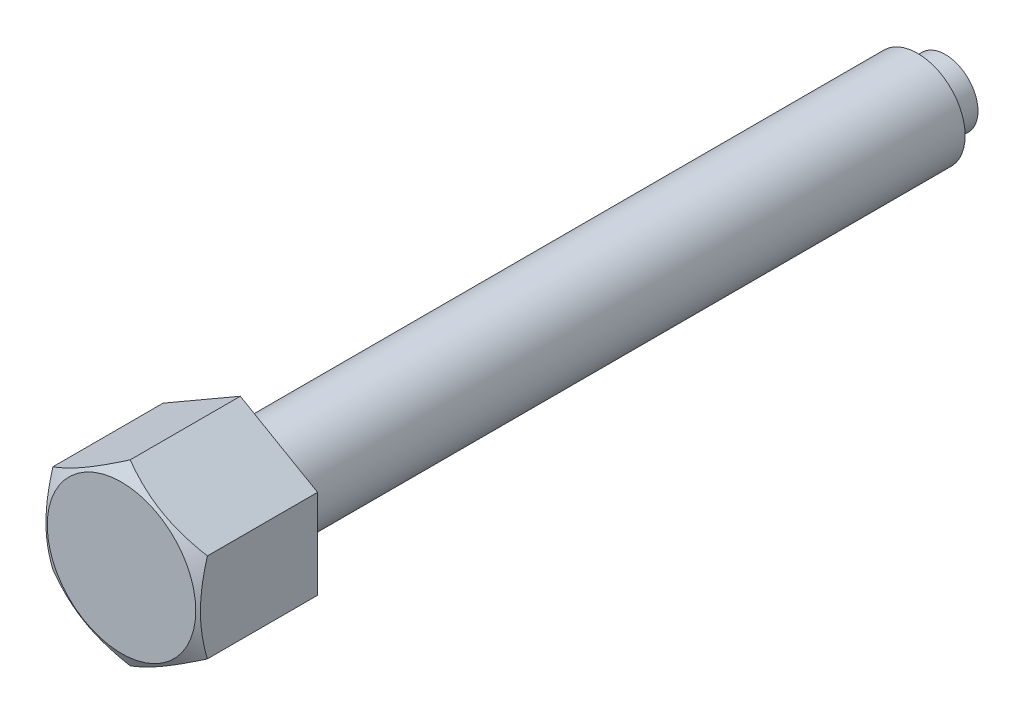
ISO-10303-21;
HEADER;
FILE_DESCRIPTION(('STEP AP214'),'2;1');
FILE_NAME('part.step','',(''),(''),'','','');
FILE_SCHEMA(('AUTOMOTIVE_DESIGN { 1 0 10303 214 1 1 1 1 }'));
ENDSEC;
DATA;
#1=APPLICATION_CONTEXT('core data for automotive mechanical design processes');
#2=APPLICATION_PROTOCOL_DEFINITION('international standard','automotive_design',2000,#1);
#3=PRODUCT_CONTEXT('',#1,'mechanical');
#4=PRODUCT('Part','Part','',(#3));
#5=PRODUCT_RELATED_PRODUCT_CATEGORY('part','',(#4));
#6=PRODUCT_DEFINITION_FORMATION('','',#4);
#7=PRODUCT_DEFINITION_CONTEXT('part definition',#1,'design');
#8=PRODUCT_DEFINITION('design','',#6,#7);
#9=PRODUCT_DEFINITION_SHAPE('','',#8);
#10=(LENGTH_UNIT() NAMED_UNIT(*) SI_UNIT(.MILLI.,.METRE.));
#11=(NAMED_UNIT(*) PLANE_ANGLE_UNIT() SI_UNIT($,.RADIAN.));
#12=(NAMED_UNIT(*) SI_UNIT($,.STERADIAN.) SOLID_ANGLE_UNIT());
#13=UNCERTAINTY_MEASURE_WITH_UNIT(LENGTH_MEASURE(1.E-05),#10,'distance_accuracy_value','');
#14=(GEOMETRIC_REPRESENTATION_CONTEXT(3) GLOBAL_UNCERTAINTY_ASSIGNED_CONTEXT((#13)) GLOBAL_UNIT_ASSIGNED_CONTEXT((#10,
#11,#12)) REPRESENTATION_CONTEXT('',''));
#15=CARTESIAN_POINT('',(0.,0.,0.));
#16=DIRECTION('',(0.,0.,1.));
#17=DIRECTION('',(1.,0.,0.));
#18=AXIS2_PLACEMENT_3D('',#15,#16,#17);
#19=CARTESIAN_POINT('',(0.,7.50555349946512,58.));
#20=DIRECTION('',(-0.5,-0.86602540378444,0.));
#21=DIRECTION('',(0.86602540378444,-0.5,0.));
#22=AXIS2_PLACEMENT_3D('',#19,#20,#21);
#23=PLANE('',#22);
#24=CARTESIAN_POINT('',(6.5002,3.75266127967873,69.2750391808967));
#25=CARTESIAN_POINT('',(6.35732254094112,3.8351516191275,69.3226580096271));
#26=CARTESIAN_POINT('',(6.21391236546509,3.91794952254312,69.3681157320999));
#27=CARTESIAN_POINT('',(5.92592736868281,4.08421773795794,69.4541137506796));
#28=CARTESIAN_POINT('',(5.78135207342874,4.16768832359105,69.4946519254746));
#29=CARTESIAN_POINT('',(5.34531134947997,4.41943655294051,69.6080914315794));
#30=CARTESIAN_POINT('',(5.05212471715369,4.58870793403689,69.6726146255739));
#31=CARTESIAN_POINT('',(4.61337625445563,4.84201947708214,69.7482758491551));
#32=CARTESIAN_POINT('',(4.46912536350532,4.92530276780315,69.7698295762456));
#33=CARTESIAN_POINT('',(4.17997178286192,5.09224566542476,69.8059721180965));
#34=CARTESIAN_POINT('',(4.03506915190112,5.17590523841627,69.8205615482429));
#35=CARTESIAN_POINT('',(3.74501222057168,5.34336968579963,69.8424036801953));
#36=CARTESIAN_POINT('',(3.59985839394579,5.42717428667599,69.8496647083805));
#37=CARTESIAN_POINT('',(3.30942466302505,5.59485627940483,69.8567021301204));
#38=CARTESIAN_POINT('',(3.16414476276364,5.6787336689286,69.8564787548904));
#39=CARTESIAN_POINT('',(2.76612405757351,5.90853103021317,69.8455789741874));
#40=CARTESIAN_POINT('',(2.51351353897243,6.05437578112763,69.8272806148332));
#41=CARTESIAN_POINT('',(2.00997032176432,6.34509659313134,69.7692560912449));
#42=CARTESIAN_POINT('',(1.75903939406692,6.48997163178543,69.7295100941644));
#43=CARTESIAN_POINT('',(1.25448277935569,6.78127752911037,69.6301565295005));
#44=CARTESIAN_POINT('',(1.0009207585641,6.92767163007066,69.5701280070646));
#45=CARTESIAN_POINT('',(0.497578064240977,7.21827667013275,69.4338874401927));
#46=CARTESIAN_POINT('',(0.247790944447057,7.36249133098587,69.357707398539));
#47=CARTESIAN_POINT('',(-0.000199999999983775,7.50566896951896,69.2750391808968));
#48=B_SPLINE_CURVE_WITH_KNOTS('',3,(#24,#25,#26,#27,#28,#29,#30,#31,#32,#33,#34,#35,#36,#37,#38,
#39,#40,#41,#42,#43,#44,#45,#46,#47),.UNSPECIFIED.,.F.,.F.,(4,2,2,2,2,2,2,2,2,2,2,4),(0.,
0.515105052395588,1.03043143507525,2.06322554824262,2.56697389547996,3.07067772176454,
3.57380860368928,4.07692394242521,4.9527935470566,5.82947446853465,6.72559912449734,
7.61996451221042),.UNSPECIFIED.);
#49=CARTESIAN_POINT('',(6.5,3.75277674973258,69.2751058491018));
#50=VERTEX_POINT('',#49);
#51=CARTESIAN_POINT('',(0.,7.50555349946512,69.2751058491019));
#52=VERTEX_POINT('',#51);
#53=EDGE_CURVE('E30',#50,#52,#48,.T.);
#54=ORIENTED_EDGE('',*,*,#53,.F.);
#55=DIRECTION('',(0.,0.,1.));
#56=VECTOR('',#55,1.);
#57=CARTESIAN_POINT('',(6.5,3.75277674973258,58.));
#58=LINE('',#57,#56);
#59=CARTESIAN_POINT('',(6.5,3.75277674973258,60.));
#60=VERTEX_POINT('',#59);
#61=EDGE_CURVE('E97',#60,#50,#58,.T.);
#62=ORIENTED_EDGE('',*,*,#61,.F.);
#63=DIRECTION('',(0.86602540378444,-0.5,0.));
#64=VECTOR('',#63,1.);
#65=CARTESIAN_POINT('',(6.25,3.89711431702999,60.));
#66=LINE('',#65,#64);
#67=CARTESIAN_POINT('',(0.,7.50555349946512,60.));
#68=VERTEX_POINT('',#67);
#69=EDGE_CURVE('E111',#68,#60,#66,.T.);
#70=ORIENTED_EDGE('',*,*,#69,.F.);
#71=DIRECTION('',(0.,0.,1.));
#72=VECTOR('',#71,1.);
#73=CARTESIAN_POINT('',(0.,7.50555349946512,58.));
#74=LINE('',#73,#72);
#75=EDGE_CURVE('E37',#68,#52,#74,.T.);
#76=ORIENTED_EDGE('',*,*,#75,.T.);
#77=EDGE_LOOP('',(#54,#62,#70,#76));
#78=FACE_BOUND('',#77,.T.);
#79=ADVANCED_FACE('F15',(#78),#23,.F.);
#80=CARTESIAN_POINT('',(6.5,3.75277674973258,58.));
#81=DIRECTION('',(-1.,0.,0.));
#82=DIRECTION('',(0.,-1.,0.));
#83=AXIS2_PLACEMENT_3D('',#80,#81,#82);
#84=PLANE('',#83);
#85=CARTESIAN_POINT('',(6.5,-10.0515847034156,66.6974731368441));
#86=CARTESIAN_POINT('',(6.5,-9.76792606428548,66.8349568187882));
#87=CARTESIAN_POINT('',(6.5,-9.48361315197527,66.9711138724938));
#88=CARTESIAN_POINT('',(6.5,-8.91333073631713,67.2400280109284));
#89=CARTESIAN_POINT('',(6.5,-8.62736097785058,67.3727845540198));
#90=CARTESIAN_POINT('',(6.5,-8.05192956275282,67.634825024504));
#91=CARTESIAN_POINT('',(6.5,-7.76245735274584,67.7640858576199));
#92=CARTESIAN_POINT('',(6.5,-7.18120041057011,68.0172790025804));
#93=CARTESIAN_POINT('',(6.5,-6.88941578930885,68.1412115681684));
#94=CARTESIAN_POINT('',(6.5,-6.29376661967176,68.3861664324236));
#95=CARTESIAN_POINT('',(6.5,-5.98981239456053,68.5069718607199));
#96=CARTESIAN_POINT('',(6.5,-5.37833695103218,68.7393695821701));
#97=CARTESIAN_POINT('',(6.5,-5.07081533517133,68.8509608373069));
#98=CARTESIAN_POINT('',(6.5,-4.45230203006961,69.0619799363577));
#99=CARTESIAN_POINT('',(6.5,-4.14131891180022,69.1614326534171));
#100=CARTESIAN_POINT('',(6.5,-3.51488874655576,69.3449632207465));
#101=CARTESIAN_POINT('',(6.5,-3.19944314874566,69.4290459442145));
#102=CARTESIAN_POINT('',(6.5,-2.56566834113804,69.5773410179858));
#103=CARTESIAN_POINT('',(6.5,-2.2473644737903,69.6416599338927));
#104=CARTESIAN_POINT('',(6.5,-1.6067839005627,69.7467562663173));
#105=CARTESIAN_POINT('',(6.5,-1.28450756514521,69.7875358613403));
#106=CARTESIAN_POINT('',(6.5,-0.80153673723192,69.8283422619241));
#107=CARTESIAN_POINT('',(6.5,-0.641661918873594,69.8385487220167));
#108=CARTESIAN_POINT('',(6.5,-0.321616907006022,69.8521994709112));
#109=CARTESIAN_POINT('',(6.5,-0.161446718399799,69.8556438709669));
#110=CARTESIAN_POINT('',(6.5,0.158894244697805,69.8556808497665));
#111=CARTESIAN_POINT('',(6.5,0.319065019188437,69.8522733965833));
#112=CARTESIAN_POINT('',(6.5,0.639121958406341,69.8386914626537));
#113=CARTESIAN_POINT('',(6.5,0.799008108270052,69.8285166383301));
#114=CARTESIAN_POINT('',(6.5,1.18413950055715,69.7960705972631));
#115=CARTESIAN_POINT('',(6.5,1.40911576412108,69.7705395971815));
#116=CARTESIAN_POINT('',(6.5,1.85736900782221,69.7074774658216));
#117=CARTESIAN_POINT('',(6.5,2.08064574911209,69.669944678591));
#118=CARTESIAN_POINT('',(6.5,2.74768779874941,69.5413362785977));
#119=CARTESIAN_POINT('',(6.5,3.18841009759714,69.4342749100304));
#120=CARTESIAN_POINT('',(6.5,3.84737304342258,69.2489911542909));
#121=CARTESIAN_POINT('',(6.5,4.06904093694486,69.1822599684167));
#122=CARTESIAN_POINT('',(6.5,4.51022306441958,69.0419589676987));
#123=CARTESIAN_POINT('',(6.5,4.72973728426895,68.9683891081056));
#124=CARTESIAN_POINT('',(6.5,5.16668293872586,68.8155834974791));
#125=CARTESIAN_POINT('',(6.5,5.38411505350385,68.7363496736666));
#126=CARTESIAN_POINT('',(6.5,5.81718397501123,68.5731391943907));
#127=CARTESIAN_POINT('',(6.5,6.0328208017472,68.4891625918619));
#128=CARTESIAN_POINT('',(6.5,6.53757204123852,68.2872206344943));
#129=CARTESIAN_POINT('',(6.5,6.8260354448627,68.1676312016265));
#130=CARTESIAN_POINT('',(6.5,7.40054651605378,67.9227677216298));
#131=CARTESIAN_POINT('',(6.5,7.68659404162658,67.7974933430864));
#132=CARTESIAN_POINT('',(6.5,8.2567123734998,67.5423901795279));
#133=CARTESIAN_POINT('',(6.5,8.54078278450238,67.4125605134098));
#134=CARTESIAN_POINT('',(6.5,9.10722885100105,67.1492488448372));
#135=CARTESIAN_POINT('',(6.5,9.38960447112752,67.0157667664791));
#136=CARTESIAN_POINT('',(6.5,9.95322274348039,66.7456918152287));
#137=CARTESIAN_POINT('',(6.5,10.2344639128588,66.6090958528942));
#138=CARTESIAN_POINT('',(6.5,10.795742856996,66.3334512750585));
#139=CARTESIAN_POINT('',(6.5,11.0757806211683,66.1944026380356));
#140=CARTESIAN_POINT('',(6.5,11.9143018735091,65.7742600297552));
#141=CARTESIAN_POINT('',(6.5,12.471266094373,65.4901342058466));
#142=CARTESIAN_POINT('',(6.5,13.5363291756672,64.9398987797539));
#143=CARTESIAN_POINT('',(6.5,14.0446624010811,64.6742408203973));
#144=CARTESIAN_POINT('',(6.5,15.0594379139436,64.1392985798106));
#145=CARTESIAN_POINT('',(6.5,15.5658801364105,63.870014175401));
#146=CARTESIAN_POINT('',(6.5,16.5760577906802,63.3293370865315));
#147=CARTESIAN_POINT('',(6.5,17.07979680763,63.0579510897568));
#148=CARTESIAN_POINT('',(6.5,18.0860635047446,62.5130059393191));
#149=CARTESIAN_POINT('',(6.5,18.5885912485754,62.2394469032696));
#150=CARTESIAN_POINT('',(6.5,19.0906720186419,61.9650754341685));
#151=B_SPLINE_CURVE_WITH_KNOTS('',3,(#85,#86,#87,#88,#89,#90,#91,#92,#93,#94,#95,#96,#97,#98,
#99,#100,#101,#102,#103,#104,#105,#106,#107,#108,#109,#110,#111,#112,#113,#114,#115,#116,#117,
#118,#119,#120,#121,#122,#123,#124,#125,#126,#127,#128,#129,#130,#131,#132,#133,#134,#135,#136,
#137,#138,#139,#140,#141,#142,#143,#144,#145,#146,#147,#148,#149,#150),.UNSPECIFIED.,.F.,.F.,(4,
2,2,2,2,2,2,2,2,2,2,2,2,2,2,2,2,2,2,2,2,2,2,2,2,2,2,2,2,2,2,2,4),(0.,0.945673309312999,
1.89149632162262,2.84251733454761,3.79349300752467,4.77462134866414,5.75586006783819,
6.73505311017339,7.71393514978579,8.68744253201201,9.66085980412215,10.1413393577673,
10.6218110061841,11.102284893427,11.5827831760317,12.2616599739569,12.9406304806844,
14.2993360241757,14.9937627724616,15.688194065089,16.3823901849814,17.076578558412,
18.0133078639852,18.9500918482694,19.887058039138,20.8240437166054,21.7620033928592,
22.6999713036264,24.5756646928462,26.2963440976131,28.0170820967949,29.7336515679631,
31.4501287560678),.UNSPECIFIED.);
#152=CARTESIAN_POINT('',(6.5,-3.75277674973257,69.2751058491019));
#153=VERTEX_POINT('',#152);
#154=EDGE_CURVE('E157',#153,#50,#151,.T.);
#155=ORIENTED_EDGE('',*,*,#154,.F.);
#156=DIRECTION('',(0.,0.,1.));
#157=VECTOR('',#156,1.);
#158=CARTESIAN_POINT('',(6.5,-3.75277674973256,58.));
#159=LINE('',#158,#157);
#160=CARTESIAN_POINT('',(6.5,-3.75277674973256,60.));
#161=VERTEX_POINT('',#160);
#162=EDGE_CURVE('E94',#161,#153,#159,.T.);
#163=ORIENTED_EDGE('',*,*,#162,.F.);
#164=DIRECTION('',(0.,-1.,0.));
#165=VECTOR('',#164,1.);
#166=CARTESIAN_POINT('',(6.5,0.,60.));
#167=LINE('',#166,#165);
#168=EDGE_CURVE('E108',#60,#161,#167,.T.);
#169=ORIENTED_EDGE('',*,*,#168,.F.);
#170=ORIENTED_EDGE('',*,*,#61,.T.);
#171=EDGE_LOOP('',(#155,#163,#169,#170));
#172=FACE_BOUND('',#171,.T.);
#173=ADVANCED_FACE('F137',(#172),#84,.F.);
#174=CARTESIAN_POINT('',(0.,-7.50555349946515,58.));
#175=DIRECTION('',(0.5,-0.866025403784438,0.));
#176=DIRECTION('',(0.866025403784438,0.5,0.));
#177=AXIS2_PLACEMENT_3D('',#174,#175,#176);
#178=PLANE('',#177);
#179=ORIENTED_EDGE('',*,*,#162,.T.);
#180=CARTESIAN_POINT('',(6.5002,-3.75266127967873,69.2750391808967));
#181=CARTESIAN_POINT('',(6.35732254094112,-3.83515161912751,69.3226580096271));
#182=CARTESIAN_POINT('',(6.21391236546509,-3.91794952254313,69.3681157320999));
#183=CARTESIAN_POINT('',(5.9259273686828,-4.08421773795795,69.4541137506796));
#184=CARTESIAN_POINT('',(5.78135207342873,-4.16768832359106,69.4946519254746));
#185=CARTESIAN_POINT('',(5.34531134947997,-4.41943655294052,69.6080914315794));
#186=CARTESIAN_POINT('',(5.05212471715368,-4.5887079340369,69.6726146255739));
#187=CARTESIAN_POINT('',(4.61337625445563,-4.84201947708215,69.7482758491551));
#188=CARTESIAN_POINT('',(4.46912536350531,-4.92530276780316,69.7698295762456));
#189=CARTESIAN_POINT('',(4.17997178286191,-5.09224566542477,69.8059721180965));
#190=CARTESIAN_POINT('',(4.03506915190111,-5.17590523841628,69.8205615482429));
#191=CARTESIAN_POINT('',(3.74501222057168,-5.34336968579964,69.8424036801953));
#192=CARTESIAN_POINT('',(3.59985839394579,-5.427174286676,69.8496647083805));
#193=CARTESIAN_POINT('',(3.30942466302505,-5.59485627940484,69.8567021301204));
#194=CARTESIAN_POINT('',(3.16414476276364,-5.67873366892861,69.8564787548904));
#195=CARTESIAN_POINT('',(2.76612405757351,-5.90853103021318,69.8455789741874));
#196=CARTESIAN_POINT('',(2.51351353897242,-6.05437578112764,69.8272806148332));
#197=CARTESIAN_POINT('',(2.00997032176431,-6.34509659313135,69.7692560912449));
#198=CARTESIAN_POINT('',(1.75903939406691,-6.48997163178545,69.7295100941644));
#199=CARTESIAN_POINT('',(1.25448277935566,-6.7812775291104,69.6301565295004));
#200=CARTESIAN_POINT('',(1.00092075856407,-6.92767163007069,69.5701280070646));
#201=CARTESIAN_POINT('',(0.497578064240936,-7.21827667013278,69.4338874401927));
#202=CARTESIAN_POINT('',(0.247790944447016,-7.3624913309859,69.357707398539));
#203=CARTESIAN_POINT('',(-0.000200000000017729,-7.50566896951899,69.2750391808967));
#204=B_SPLINE_CURVE_WITH_KNOTS('',3,(#180,#181,#182,#183,#184,#185,#186,#187,#188,#189,#190,
#191,#192,#193,#194,#195,#196,#197,#198,#199,#200,#201,#202,#203),.UNSPECIFIED.,.F.,.F.,(4,2,2,
2,2,2,2,2,2,2,2,4),(0.,0.515105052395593,1.03043143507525,2.06322554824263,2.56697389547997,
3.07067772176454,3.57380860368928,4.07692394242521,4.95279354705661,5.82947446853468,
6.72559912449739,7.61996451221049),.UNSPECIFIED.);
#205=CARTESIAN_POINT('',(0.,-7.50555349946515,69.2751058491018));
#206=VERTEX_POINT('',#205);
#207=EDGE_CURVE('E163',#153,#206,#204,.T.);
#208=ORIENTED_EDGE('',*,*,#207,.T.);
#209=DIRECTION('',(0.,0.,1.));
#210=VECTOR('',#209,1.);
#211=CARTESIAN_POINT('',(0.,-7.50555349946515,58.));
#212=LINE('',#211,#210);
#213=CARTESIAN_POINT('',(0.,-7.50555349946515,60.));
#214=VERTEX_POINT('',#213);
#215=EDGE_CURVE('E87',#214,#206,#212,.T.);
#216=ORIENTED_EDGE('',*,*,#215,.F.);
#217=DIRECTION('',(0.866025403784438,0.5,0.));
#218=VECTOR('',#217,1.);
#219=CARTESIAN_POINT('',(6.25,-3.89711431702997,60.));
#220=LINE('',#219,#218);
#221=EDGE_CURVE('E106',#214,#161,#220,.T.);
#222=ORIENTED_EDGE('',*,*,#221,.T.);
#223=EDGE_LOOP('',(#179,#208,#216,#222));
#224=FACE_BOUND('',#223,.T.);
#225=ADVANCED_FACE('F143',(#224),#178,.T.);
#226=CARTESIAN_POINT('',(0.,-7.50555349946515,58.));
#227=DIRECTION('',(0.5,0.866025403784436,0.));
#228=DIRECTION('',(-0.866025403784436,0.5,0.));
#229=AXIS2_PLACEMENT_3D('',#226,#227,#228);
#230=PLANE('',#229);
#231=CARTESIAN_POINT('',(-6.5002,-3.75266127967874,69.2750391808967));
#232=CARTESIAN_POINT('',(-6.35732254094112,-3.83515161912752,69.3226580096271));
#233=CARTESIAN_POINT('',(-6.21391236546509,-3.91794952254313,69.3681157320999));
#234=CARTESIAN_POINT('',(-5.92592736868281,-4.08421773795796,69.4541137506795));
#235=CARTESIAN_POINT('',(-5.78135207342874,-4.16768832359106,69.4946519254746));
#236=CARTESIAN_POINT('',(-5.34531134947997,-4.41943655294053,69.6080914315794));
#237=CARTESIAN_POINT('',(-5.05212471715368,-4.58870793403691,69.6726146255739));
#238=CARTESIAN_POINT('',(-4.61337625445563,-4.84201947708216,69.7482758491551));
#239=CARTESIAN_POINT('',(-4.46912536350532,-4.92530276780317,69.7698295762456));
#240=CARTESIAN_POINT('',(-4.17997178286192,-5.09224566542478,69.8059721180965));
#241=CARTESIAN_POINT('',(-4.03506915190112,-5.17590523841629,69.8205615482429));
#242=CARTESIAN_POINT('',(-3.74501222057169,-5.34336968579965,69.8424036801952));
#243=CARTESIAN_POINT('',(-3.59985839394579,-5.42717428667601,69.8496647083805));
#244=CARTESIAN_POINT('',(-3.30942466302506,-5.59485627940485,69.8567021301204));
#245=CARTESIAN_POINT('',(-3.16414476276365,-5.67873366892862,69.8564787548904));
#246=CARTESIAN_POINT('',(-2.76612405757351,-5.90853103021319,69.8455789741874));
#247=CARTESIAN_POINT('',(-2.51351353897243,-6.05437578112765,69.8272806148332));
#248=CARTESIAN_POINT('',(-2.00997032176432,-6.34509659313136,69.7692560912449));
#249=CARTESIAN_POINT('',(-1.75903939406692,-6.48997163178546,69.7295100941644));
#250=CARTESIAN_POINT('',(-1.25448277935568,-6.7812775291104,69.6301565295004));
#251=CARTESIAN_POINT('',(-1.00092075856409,-6.92767163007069,69.5701280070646));
#252=CARTESIAN_POINT('',(-0.497578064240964,-7.21827667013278,69.4338874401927));
#253=CARTESIAN_POINT('',(-0.247790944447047,-7.3624913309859,69.357707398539));
#254=CARTESIAN_POINT('',(0.000199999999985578,-7.50566896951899,69.2750391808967));
#255=B_SPLINE_CURVE_WITH_KNOTS('',3,(#231,#232,#233,#234,#235,#236,#237,#238,#239,#240,#241,
#242,#243,#244,#245,#246,#247,#248,#249,#250,#251,#252,#253,#254),.UNSPECIFIED.,.F.,.F.,(4,2,2,
2,2,2,2,2,2,2,2,4),(0.,0.515105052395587,1.03043143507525,2.06322554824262,2.56697389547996,
3.07067772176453,3.57380860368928,4.0769239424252,4.9527935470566,5.82947446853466,
6.72559912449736,7.61996451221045),.UNSPECIFIED.);
#256=CARTESIAN_POINT('',(-6.5,-3.75277674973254,69.2751058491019));
#257=VERTEX_POINT('',#256);
#258=EDGE_CURVE('E81',#257,#206,#255,.T.);
#259=ORIENTED_EDGE('',*,*,#258,.F.);
#260=DIRECTION('',(0.,0.,1.));
#261=VECTOR('',#260,1.);
#262=CARTESIAN_POINT('',(-6.5,-3.75277674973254,58.));
#263=LINE('',#262,#261);
#264=CARTESIAN_POINT('',(-6.5,-3.75277674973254,60.));
#265=VERTEX_POINT('',#264);
#266=EDGE_CURVE('E80',#265,#257,#263,.T.);
#267=ORIENTED_EDGE('',*,*,#266,.F.);
#268=DIRECTION('',(-0.866025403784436,0.5,0.));
#269=VECTOR('',#268,1.);
#270=CARTESIAN_POINT('',(-0.250000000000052,-7.36121593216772,60.));
#271=LINE('',#270,#269);
#272=EDGE_CURVE('E103',#214,#265,#271,.T.);
#273=ORIENTED_EDGE('',*,*,#272,.F.);
#274=ORIENTED_EDGE('',*,*,#215,.T.);
#275=EDGE_LOOP('',(#259,#267,#273,#274));
#276=FACE_BOUND('',#275,.T.);
#277=ADVANCED_FACE('F239',(#276),#230,.F.);
#278=CARTESIAN_POINT('',(-6.5,3.75277674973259,58.));
#279=DIRECTION('',(-1.,0.,0.));
#280=DIRECTION('',(0.,-1.,0.));
#281=AXIS2_PLACEMENT_3D('',#278,#279,#280);
#282=PLANE('',#281);
#283=ORIENTED_EDGE('',*,*,#266,.T.);
#284=CARTESIAN_POINT('',(-6.5,-10.0515847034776,66.6974731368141));
#285=CARTESIAN_POINT('',(-6.5,-9.76792606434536,66.8349568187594));
#286=CARTESIAN_POINT('',(-6.5,-9.48361315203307,66.9711138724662));
#287=CARTESIAN_POINT('',(-6.5,-8.91333073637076,67.2400280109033));
#288=CARTESIAN_POINT('',(-6.5,-8.62736097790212,67.372784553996));
#289=CARTESIAN_POINT('',(-6.5,-8.05192956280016,67.6348250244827));
#290=CARTESIAN_POINT('',(-6.5,-7.76245735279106,67.7640858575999));
#291=CARTESIAN_POINT('',(-6.5,-7.18120041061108,68.0172790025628));
#292=CARTESIAN_POINT('',(-6.5,-6.88941578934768,68.1412115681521));
#293=CARTESIAN_POINT('',(-6.5,-6.29376661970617,68.3861664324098));
#294=CARTESIAN_POINT('',(-6.5,-5.98981239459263,68.5069718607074));
#295=CARTESIAN_POINT('',(-6.5,-5.37833695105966,68.73936958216));
#296=CARTESIAN_POINT('',(-6.5,-5.07081533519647,68.850960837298));
#297=CARTESIAN_POINT('',(-6.5,-4.45230203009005,69.0619799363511));
#298=CARTESIAN_POINT('',(-6.5,-4.14131891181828,69.1614326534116));
#299=CARTESIAN_POINT('',(-6.5,-3.51488874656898,69.3449632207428));
#300=CARTESIAN_POINT('',(-6.5,-3.19944314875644,69.4290459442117));
#301=CARTESIAN_POINT('',(-6.5,-2.56566834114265,69.5773410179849));
#302=CARTESIAN_POINT('',(-6.5,-2.24736447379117,69.6416599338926));
#303=CARTESIAN_POINT('',(-6.5,-1.60678390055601,69.7467562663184));
#304=CARTESIAN_POINT('',(-6.5,-1.28450756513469,69.7875358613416));
#305=CARTESIAN_POINT('',(-6.5,-0.801536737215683,69.8283422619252));
#306=CARTESIAN_POINT('',(-6.5,-0.64166191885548,69.8385487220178));
#307=CARTESIAN_POINT('',(-6.5,-0.32161690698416,69.8521994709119));
#308=CARTESIAN_POINT('',(-6.5,-0.161446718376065,69.8556438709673));
#309=CARTESIAN_POINT('',(-6.5,0.158894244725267,69.8556808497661));
#310=CARTESIAN_POINT('',(-6.5,0.319065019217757,69.8522733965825));
#311=CARTESIAN_POINT('',(-6.5,0.639121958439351,69.8386914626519));
#312=CARTESIAN_POINT('',(-6.5,0.799008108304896,69.8285166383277));
#313=CARTESIAN_POINT('',(-6.5,1.18413950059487,69.7960705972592));
#314=CARTESIAN_POINT('',(-6.5,1.40911576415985,69.7705395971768));
#315=CARTESIAN_POINT('',(-6.5,1.85736900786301,69.7074774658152));
#316=CARTESIAN_POINT('',(-6.5,2.08064574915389,69.6699446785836));
#317=CARTESIAN_POINT('',(-6.5,2.74768779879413,69.5413362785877));
#318=CARTESIAN_POINT('',(-6.5,3.18841009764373,69.4342749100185));
#319=CARTESIAN_POINT('',(-6.5,3.84737304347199,69.2489911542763));
#320=CARTESIAN_POINT('',(-6.5,4.06904093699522,69.1822599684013));
#321=CARTESIAN_POINT('',(-6.5,4.51022306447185,69.0419589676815));
#322=CARTESIAN_POINT('',(-6.5,4.72973728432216,68.9683891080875));
#323=CARTESIAN_POINT('',(-6.5,5.16668293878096,68.8155834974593));
#324=CARTESIAN_POINT('',(-6.5,5.3841150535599,68.7363496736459));
#325=CARTESIAN_POINT('',(-6.5,5.81718397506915,68.5731391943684));
#326=CARTESIAN_POINT('',(-6.5,6.03282080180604,68.4891625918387));
#327=CARTESIAN_POINT('',(-6.5,6.53757204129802,68.2872206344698));
#328=CARTESIAN_POINT('',(-6.5,6.82603544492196,68.1676312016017));
#329=CARTESIAN_POINT('',(-6.5,7.40054651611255,67.9227677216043));
#330=CARTESIAN_POINT('',(-6.5,7.68659404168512,67.7974933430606));
#331=CARTESIAN_POINT('',(-6.5,8.25671237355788,67.5423901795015));
#332=CARTESIAN_POINT('',(-6.5,8.54078278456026,67.4125605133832));
#333=CARTESIAN_POINT('',(-6.5,9.10722885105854,67.1492488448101));
#334=CARTESIAN_POINT('',(-6.5,9.38960447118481,67.0157667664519));
#335=CARTESIAN_POINT('',(-6.5,9.95322274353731,66.7456918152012));
#336=CARTESIAN_POINT('',(-6.5,10.2344639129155,66.6090958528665));
#337=CARTESIAN_POINT('',(-6.5,10.7957428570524,66.3334512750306));
#338=CARTESIAN_POINT('',(-6.5,11.0757806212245,66.1944026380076));
#339=CARTESIAN_POINT('',(-6.5,11.9143018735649,65.7742600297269));
#340=CARTESIAN_POINT('',(-6.5,12.4712660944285,65.4901342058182));
#341=CARTESIAN_POINT('',(-6.5,13.5363291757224,64.9398987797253));
#342=CARTESIAN_POINT('',(-6.5,14.0446624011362,64.6742408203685));
#343=CARTESIAN_POINT('',(-6.5,15.0594379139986,64.1392985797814));
#344=CARTESIAN_POINT('',(-6.5,15.5658801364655,63.8700141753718));
#345=CARTESIAN_POINT('',(-6.5,16.5760577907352,63.3293370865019));
#346=CARTESIAN_POINT('',(-6.5,17.0797968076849,63.0579510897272));
#347=CARTESIAN_POINT('',(-6.5,18.0860635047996,62.5130059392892));
#348=CARTESIAN_POINT('',(-6.5,18.5885912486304,62.2394469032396));
#349=CARTESIAN_POINT('',(-6.5,19.0906720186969,61.9650754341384));
#350=B_SPLINE_CURVE_WITH_KNOTS('',3,(#284,#285,#286,#287,#288,#289,#290,#291,#292,#293,#294,
#295,#296,#297,#298,#299,#300,#301,#302,#303,#304,#305,#306,#307,#308,#309,#310,#311,#312,#313,
#314,#315,#316,#317,#318,#319,#320,#321,#322,#323,#324,#325,#326,#327,#328,#329,#330,#331,#332,
#333,#334,#335,#336,#337,#338,#339,#340,#341,#342,#343,#344,#345,#346,#347,#348,#349),
.UNSPECIFIED.,.F.,.F.,(4,2,2,2,2,2,2,2,2,2,2,2,2,2,2,2,2,2,2,2,2,2,2,2,2,2,2,2,2,2,2,2,4),(0.,
0.945673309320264,1.89149632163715,2.84251733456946,3.79349300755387,4.77462134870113,
5.75586006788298,6.73505311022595,7.71393514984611,8.6874425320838,9.6608598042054,
10.1413393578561,10.6218110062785,11.102284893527,11.5827831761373,12.2616599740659,
12.9406304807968,14.2993360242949,14.9937627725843,15.6881940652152,16.3823901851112,
17.0765785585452,18.0133078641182,18.9500918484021,19.8870580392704,20.8240437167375,
21.762003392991,22.699971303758,24.5756646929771,26.2963440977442,28.017082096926,
29.7336515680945,31.4501287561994),.UNSPECIFIED.);
#351=CARTESIAN_POINT('',(-6.5,3.75277674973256,69.2751058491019));
#352=VERTEX_POINT('',#351);
#353=EDGE_CURVE('E68',#257,#352,#350,.T.);
#354=ORIENTED_EDGE('',*,*,#353,.T.);
#355=DIRECTION('',(0.,0.,1.));
#356=VECTOR('',#355,1.);
#357=CARTESIAN_POINT('',(-6.5,3.75277674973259,58.));
#358=LINE('',#357,#356);
#359=CARTESIAN_POINT('',(-6.5,3.75277674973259,60.));
#360=VERTEX_POINT('',#359);
#361=EDGE_CURVE('E77',#360,#352,#358,.T.);
#362=ORIENTED_EDGE('',*,*,#361,.F.);
#363=DIRECTION('',(0.,-1.,0.));
#364=VECTOR('',#363,1.);
#365=CARTESIAN_POINT('',(-6.5,0.,60.));
#366=LINE('',#365,#364);
#367=EDGE_CURVE('E101',#360,#265,#366,.T.);
#368=ORIENTED_EDGE('',*,*,#367,.T.);
#369=EDGE_LOOP('',(#283,#354,#362,#368));
#370=FACE_BOUND('',#369,.T.);
#371=ADVANCED_FACE('F76',(#370),#282,.T.);
#372=CARTESIAN_POINT('',(0.,7.50555349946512,58.));
#373=DIRECTION('',(-0.5,0.866025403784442,0.));
#374=DIRECTION('',(-0.866025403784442,-0.5,0.));
#375=AXIS2_PLACEMENT_3D('',#372,#373,#374);
#376=PLANE('',#375);
#377=ORIENTED_EDGE('',*,*,#361,.T.);
#378=CARTESIAN_POINT('',(-6.5002,3.75266127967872,69.2750391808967));
#379=CARTESIAN_POINT('',(-6.35732254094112,3.83515161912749,69.3226580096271));
#380=CARTESIAN_POINT('',(-6.21391236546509,3.91794952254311,69.3681157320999));
#381=CARTESIAN_POINT('',(-5.92592736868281,4.08421773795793,69.4541137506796));
#382=CARTESIAN_POINT('',(-5.78135207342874,4.16768832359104,69.4946519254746));
#383=CARTESIAN_POINT('',(-5.34531134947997,4.4194365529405,69.6080914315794));
#384=CARTESIAN_POINT('',(-5.05212471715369,4.58870793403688,69.6726146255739));
#385=CARTESIAN_POINT('',(-4.61337625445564,4.84201947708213,69.7482758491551));
#386=CARTESIAN_POINT('',(-4.46912536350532,4.92530276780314,69.7698295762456));
#387=CARTESIAN_POINT('',(-4.17997178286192,5.09224566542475,69.8059721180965));
#388=CARTESIAN_POINT('',(-4.03506915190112,5.17590523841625,69.8205615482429));
#389=CARTESIAN_POINT('',(-3.74501222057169,5.34336968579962,69.8424036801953));
#390=CARTESIAN_POINT('',(-3.5998583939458,5.42717428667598,69.8496647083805));
#391=CARTESIAN_POINT('',(-3.30942466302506,5.59485627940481,69.8567021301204));
#392=CARTESIAN_POINT('',(-3.16414476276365,5.67873366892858,69.8564787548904));
#393=CARTESIAN_POINT('',(-2.76612405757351,5.90853103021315,69.8455789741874));
#394=CARTESIAN_POINT('',(-2.51351353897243,6.05437578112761,69.8272806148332));
#395=CARTESIAN_POINT('',(-2.00997032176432,6.34509659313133,69.769256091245));
#396=CARTESIAN_POINT('',(-1.75903939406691,6.48997163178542,69.7295100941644));
#397=CARTESIAN_POINT('',(-1.25448277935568,6.78127752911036,69.6301565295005));
#398=CARTESIAN_POINT('',(-1.00092075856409,6.92767163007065,69.5701280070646));
#399=CARTESIAN_POINT('',(-0.497578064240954,7.21827667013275,69.4338874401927));
#400=CARTESIAN_POINT('',(-0.247790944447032,7.36249133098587,69.357707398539));
#401=CARTESIAN_POINT('',(0.000200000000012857,7.50566896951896,69.2750391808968));
#402=B_SPLINE_CURVE_WITH_KNOTS('',3,(#378,#379,#380,#381,#382,#383,#384,#385,#386,#387,#388,
#389,#390,#391,#392,#393,#394,#395,#396,#397,#398,#399,#400,#401),.UNSPECIFIED.,.F.,.F.,(4,2,2,
2,2,2,2,2,2,2,2,4),(0.,0.515105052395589,1.03043143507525,2.06322554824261,2.56697389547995,
3.07067772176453,3.57380860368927,4.0769239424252,4.9527935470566,5.82947446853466,
6.72559912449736,7.61996451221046),.UNSPECIFIED.);
#403=EDGE_CURVE('E65',#352,#52,#402,.T.);
#404=ORIENTED_EDGE('',*,*,#403,.T.);
#405=ORIENTED_EDGE('',*,*,#75,.F.);
#406=DIRECTION('',(-0.866025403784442,-0.5,0.));
#407=VECTOR('',#406,1.);
#408=CARTESIAN_POINT('',(-0.249999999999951,7.36121593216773,60.));
#409=LINE('',#408,#407);
#410=EDGE_CURVE('E85',#68,#360,#409,.T.);
#411=ORIENTED_EDGE('',*,*,#410,.T.);
#412=EDGE_LOOP('',(#377,#404,#405,#411));
#413=FACE_BOUND('',#412,.T.);
#414=ADVANCED_FACE('F83',(#413),#376,.T.);
#415=CARTESIAN_POINT('',(0.,0.,6.));
#416=DIRECTION('',(0.,0.,1.));
#417=DIRECTION('',(1.,0.,0.));
#418=AXIS2_PLACEMENT_3D('',#415,#416,#417);
#419=SPHERICAL_SURFACE('',#418,6.);
#420=CARTESIAN_POINT('',(0.,0.,0.667317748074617));
#421=DIRECTION('',(0.,0.,1.));
#422=DIRECTION('',(1.,0.,0.));
#423=AXIS2_PLACEMENT_3D('',#420,#421,#422);
#424=CIRCLE('',#423,2.75);
#425=CARTESIAN_POINT('',(2.75,0.,0.667317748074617));
#426=VERTEX_POINT('',#425);
#427=EDGE_CURVE('E9',#426,#426,#424,.T.);
#428=ORIENTED_EDGE('',*,*,#427,.F.);
#429=EDGE_LOOP('',(#428));
#430=FACE_BOUND('',#429,.T.);
#431=ADVANCED_FACE('F17',(#430),#419,.T.);
#432=CARTESIAN_POINT('',(0.,0.,110.));
#433=DIRECTION('',(0.,0.,1.));
#434=DIRECTION('',(1.,0.,0.));
#435=AXIS2_PLACEMENT_3D('',#432,#433,#434);
#436=CYLINDRICAL_SURFACE('',#435,2.75);
#437=ORIENTED_EDGE('',*,*,#427,.T.);
#438=EDGE_LOOP('',(#437));
#439=FACE_BOUND('',#438,.T.);
#440=CARTESIAN_POINT('',(0.,0.,3.));
#441=DIRECTION('',(0.,0.,1.));
#442=DIRECTION('',(1.,0.,0.));
#443=AXIS2_PLACEMENT_3D('',#440,#441,#442);
#444=CIRCLE('',#443,2.75);
#445=CARTESIAN_POINT('',(2.75,0.,3.));
#446=VERTEX_POINT('',#445);
#447=EDGE_CURVE('E23',#446,#446,#444,.T.);
#448=ORIENTED_EDGE('',*,*,#447,.F.);
#449=EDGE_LOOP('',(#448));
#450=FACE_BOUND('',#449,.T.);
#451=ADVANCED_FACE('F124',(#439,#450),#436,.T.);
#452=CARTESIAN_POINT('',(2.75,0.,3.));
#453=DIRECTION('',(0.,0.,1.));
#454=DIRECTION('',(1.,0.,0.));
#455=AXIS2_PLACEMENT_3D('',#452,#453,#454);
#456=PLANE('',#455);
#457=CARTESIAN_POINT('',(0.,0.,3.));
#458=DIRECTION('',(0.,0.,1.));
#459=DIRECTION('',(1.,0.,0.));
#460=AXIS2_PLACEMENT_3D('',#457,#458,#459);
#461=CIRCLE('',#460,4.);
#462=CARTESIAN_POINT('',(4.,0.,3.));
#463=VERTEX_POINT('',#462);
#464=EDGE_CURVE('E117',#463,#463,#461,.T.);
#465=ORIENTED_EDGE('',*,*,#464,.F.);
#466=EDGE_LOOP('',(#465));
#467=FACE_BOUND('',#466,.T.);
#468=ORIENTED_EDGE('',*,*,#447,.T.);
#469=EDGE_LOOP('',(#468));
#470=FACE_BOUND('',#469,.T.);
#471=ADVANCED_FACE('F122',(#467,#470),#456,.F.);
#472=CARTESIAN_POINT('',(0.,0.,110.));
#473=DIRECTION('',(0.,0.,1.));
#474=DIRECTION('',(1.,0.,0.));
#475=AXIS2_PLACEMENT_3D('',#472,#473,#474);
#476=CYLINDRICAL_SURFACE('',#475,4.);
#477=CARTESIAN_POINT('',(0.,0.,60.));
#478=DIRECTION('',(0.,0.,1.));
#479=DIRECTION('',(1.,0.,0.));
#480=AXIS2_PLACEMENT_3D('',#477,#478,#479);
#481=CIRCLE('',#480,4.);
#482=CARTESIAN_POINT('',(4.,0.,60.));
#483=VERTEX_POINT('',#482);
#484=EDGE_CURVE('E114',#483,#483,#481,.T.);
#485=ORIENTED_EDGE('',*,*,#484,.F.);
#486=EDGE_LOOP('',(#485));
#487=FACE_BOUND('',#486,.T.);
#488=ORIENTED_EDGE('',*,*,#464,.T.);
#489=EDGE_LOOP('',(#488));
#490=FACE_BOUND('',#489,.T.);
#491=ADVANCED_FACE('F132',(#487,#490),#476,.T.);
#492=CARTESIAN_POINT('',(4.,0.,60.));
#493=DIRECTION('',(0.,0.,1.));
#494=DIRECTION('',(1.,0.,0.));
#495=AXIS2_PLACEMENT_3D('',#492,#493,#494);
#496=PLANE('',#495);
#497=ORIENTED_EDGE('',*,*,#410,.F.);
#498=ORIENTED_EDGE('',*,*,#69,.T.);
#499=ORIENTED_EDGE('',*,*,#168,.T.);
#500=ORIENTED_EDGE('',*,*,#221,.F.);
#501=ORIENTED_EDGE('',*,*,#272,.T.);
#502=ORIENTED_EDGE('',*,*,#367,.F.);
#503=EDGE_LOOP('',(#497,#498,#499,#500,#501,#502));
#504=FACE_BOUND('',#503,.T.);
#505=ORIENTED_EDGE('',*,*,#484,.T.);
#506=EDGE_LOOP('',(#505));
#507=FACE_BOUND('',#506,.T.);
#508=ADVANCED_FACE('F178',(#504,#507),#496,.F.);
#509=CARTESIAN_POINT('',(0.,0.,70.));
#510=DIRECTION('',(0.,0.,-1.));
#511=DIRECTION('',(-1.,0.,0.));
#512=AXIS2_PLACEMENT_3D('',#509,#510,#511);
#513=CONICAL_SURFACE('',#512,6.25,1.0471975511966);
#514=CARTESIAN_POINT('',(0.,0.,70.));
#515=DIRECTION('',(0.,0.,1.));
#516=DIRECTION('',(1.,0.,0.));
#517=AXIS2_PLACEMENT_3D('',#514,#515,#516);
#518=CIRCLE('',#517,6.25);
#519=CARTESIAN_POINT('',(6.25,0.,70.));
#520=VERTEX_POINT('',#519);
#521=EDGE_CURVE('E71',#520,#520,#518,.T.);
#522=ORIENTED_EDGE('',*,*,#521,.F.);
#523=EDGE_LOOP('',(#522));
#524=FACE_BOUND('',#523,.T.);
#525=ORIENTED_EDGE('',*,*,#53,.T.);
#526=ORIENTED_EDGE('',*,*,#403,.F.);
#527=ORIENTED_EDGE('',*,*,#353,.F.);
#528=ORIENTED_EDGE('',*,*,#258,.T.);
#529=ORIENTED_EDGE('',*,*,#207,.F.);
#530=ORIENTED_EDGE('',*,*,#154,.T.);
#531=EDGE_LOOP('',(#525,#526,#527,#528,#529,#530));
#532=FACE_BOUND('',#531,.T.);
#533=ADVANCED_FACE('F67',(#524,#532),#513,.T.);
#534=CARTESIAN_POINT('',(0.,0.,70.));
#535=DIRECTION('',(0.,0.,1.));
#536=DIRECTION('',(1.,0.,0.));
#537=AXIS2_PLACEMENT_3D('',#534,#535,#536);
#538=PLANE('',#537);
#539=ORIENTED_EDGE('',*,*,#521,.T.);
#540=EDGE_LOOP('',(#539));
#541=FACE_BOUND('',#540,.T.);
#542=ADVANCED_FACE('F174',(#541),#538,.T.);
#543=CLOSED_SHELL('',(#79,#173,#225,#277,#371,#414,#431,#451,#471,#491,#508,#533,#542));
#544=MANIFOLD_SOLID_BREP('B1',#543);
#545=ADVANCED_BREP_SHAPE_REPRESENTATION('',(#18,#544),#14);
#546=SHAPE_DEFINITION_REPRESENTATION(#9,#545);
ENDSEC;
END-ISO-10303-21;
